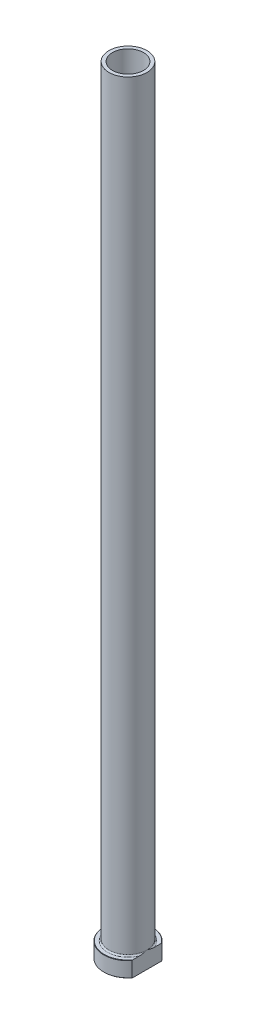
ISO-10303-21;
HEADER;
FILE_DESCRIPTION(('STEP AP214'),'2;1');
FILE_NAME('part.step','',(''),(''),'','','');
FILE_SCHEMA(('AUTOMOTIVE_DESIGN { 1 0 10303 214 1 1 1 1 }'));
ENDSEC;
DATA;
#1=APPLICATION_CONTEXT('core data for automotive mechanical design processes');
#2=APPLICATION_PROTOCOL_DEFINITION('international standard','automotive_design',2000,#1);
#3=PRODUCT_CONTEXT('',#1,'mechanical');
#4=PRODUCT('Part','Part','',(#3));
#5=PRODUCT_RELATED_PRODUCT_CATEGORY('part','',(#4));
#6=PRODUCT_DEFINITION_FORMATION('','',#4);
#7=PRODUCT_DEFINITION_CONTEXT('part definition',#1,'design');
#8=PRODUCT_DEFINITION('design','',#6,#7);
#9=PRODUCT_DEFINITION_SHAPE('','',#8);
#10=(LENGTH_UNIT() NAMED_UNIT(*) SI_UNIT(.MILLI.,.METRE.));
#11=(NAMED_UNIT(*) PLANE_ANGLE_UNIT() SI_UNIT($,.RADIAN.));
#12=(NAMED_UNIT(*) SI_UNIT($,.STERADIAN.) SOLID_ANGLE_UNIT());
#13=UNCERTAINTY_MEASURE_WITH_UNIT(LENGTH_MEASURE(1.E-05),#10,'distance_accuracy_value','');
#14=(GEOMETRIC_REPRESENTATION_CONTEXT(3) GLOBAL_UNCERTAINTY_ASSIGNED_CONTEXT((#13)) GLOBAL_UNIT_ASSIGNED_CONTEXT((#10,
#11,#12)) REPRESENTATION_CONTEXT('',''));
#15=CARTESIAN_POINT('',(0.,0.,0.));
#16=DIRECTION('',(0.,0.,1.));
#17=DIRECTION('',(1.,0.,0.));
#18=AXIS2_PLACEMENT_3D('',#15,#16,#17);
#19=CARTESIAN_POINT('',(0.,92.1876809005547,0.));
#20=DIRECTION('',(0.,1.,0.));
#21=DIRECTION('',(0.,0.,1.));
#22=AXIS2_PLACEMENT_3D('',#19,#20,#21);
#23=CYLINDRICAL_SURFACE('',#22,9.00000000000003);
#24=CARTESIAN_POINT('',(0.,450.,0.));
#25=DIRECTION('',(0.,1.,0.));
#26=DIRECTION('',(0.,0.,1.));
#27=AXIS2_PLACEMENT_3D('',#24,#25,#26);
#28=CIRCLE('',#27,9.00000000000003);
#29=CARTESIAN_POINT('',(0.,450.,9.00000000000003));
#30=VERTEX_POINT('',#29);
#31=EDGE_CURVE('E167',#30,#30,#28,.T.);
#32=ORIENTED_EDGE('',*,*,#31,.T.);
#33=EDGE_LOOP('',(#32));
#34=FACE_BOUND('',#33,.T.);
#35=CARTESIAN_POINT('',(0.,395.,0.));
#36=DIRECTION('',(0.,1.,0.));
#37=DIRECTION('',(0.,0.,1.));
#38=AXIS2_PLACEMENT_3D('',#35,#36,#37);
#39=CIRCLE('',#38,9.00000000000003);
#40=CARTESIAN_POINT('',(0.,395.,9.00000000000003));
#41=VERTEX_POINT('',#40);
#42=EDGE_CURVE('E170',#41,#41,#39,.T.);
#43=ORIENTED_EDGE('',*,*,#42,.F.);
#44=EDGE_LOOP('',(#43));
#45=FACE_BOUND('',#44,.T.);
#46=ADVANCED_FACE('F32',(#34,#45),#23,.F.);
#47=CARTESIAN_POINT('',(-9.00000000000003,450.,0.));
#48=DIRECTION('',(0.,1.,0.));
#49=DIRECTION('',(0.,0.,1.));
#50=AXIS2_PLACEMENT_3D('',#47,#48,#49);
#51=PLANE('',#50);
#52=CARTESIAN_POINT('',(0.,450.,0.));
#53=DIRECTION('',(0.,1.,0.));
#54=DIRECTION('',(0.,0.,1.));
#55=AXIS2_PLACEMENT_3D('',#52,#53,#54);
#56=CIRCLE('',#55,11.);
#57=CARTESIAN_POINT('',(0.,450.,11.));
#58=VERTEX_POINT('',#57);
#59=EDGE_CURVE('E174',#58,#58,#56,.T.);
#60=ORIENTED_EDGE('',*,*,#59,.T.);
#61=EDGE_LOOP('',(#60));
#62=FACE_BOUND('',#61,.T.);
#63=ORIENTED_EDGE('',*,*,#31,.F.);
#64=EDGE_LOOP('',(#63));
#65=FACE_BOUND('',#64,.T.);
#66=ADVANCED_FACE('F157',(#62,#65),#51,.T.);
#67=CARTESIAN_POINT('',(0.,92.1876809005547,0.));
#68=DIRECTION('',(0.,1.,0.));
#69=DIRECTION('',(0.,0.,1.));
#70=AXIS2_PLACEMENT_3D('',#67,#68,#69);
#71=CYLINDRICAL_SURFACE('',#70,11.);
#72=CARTESIAN_POINT('',(0.,9.8,0.));
#73=DIRECTION('',(0.,1.,0.));
#74=DIRECTION('',(0.,0.,1.));
#75=AXIS2_PLACEMENT_3D('',#72,#73,#74);
#76=CIRCLE('',#75,11.);
#77=CARTESIAN_POINT('',(11.,9.8,0.));
#78=VERTEX_POINT('',#77);
#79=EDGE_CURVE('E180',#78,#78,#76,.T.);
#80=ORIENTED_EDGE('',*,*,#79,.T.);
#81=EDGE_LOOP('',(#80));
#82=FACE_BOUND('',#81,.T.);
#83=ORIENTED_EDGE('',*,*,#59,.F.);
#84=EDGE_LOOP('',(#83));
#85=FACE_BOUND('',#84,.T.);
#86=ADVANCED_FACE('F162',(#82,#85),#71,.T.);
#87=CARTESIAN_POINT('',(-11.,9.,0.));
#88=DIRECTION('',(0.,1.,0.));
#89=DIRECTION('',(0.,0.,1.));
#90=AXIS2_PLACEMENT_3D('',#87,#88,#89);
#91=PLANE('',#90);
#92=DIRECTION('',(0.,0.,1.));
#93=VECTOR('',#92,1.);
#94=CARTESIAN_POINT('',(11.,9.,0.));
#95=LINE('',#94,#93);
#96=CARTESIAN_POINT('',(11.,9.,-8.33306666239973));
#97=VERTEX_POINT('',#96);
#98=CARTESIAN_POINT('',(11.,9.,-4.27083130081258));
#99=VERTEX_POINT('',#98);
#100=EDGE_CURVE('E54',#97,#99,#95,.T.);
#101=ORIENTED_EDGE('',*,*,#100,.F.);
#102=CARTESIAN_POINT('',(0.,9.,0.));
#103=DIRECTION('',(0.,1.,0.));
#104=DIRECTION('',(0.,0.,1.));
#105=AXIS2_PLACEMENT_3D('',#102,#103,#104);
#106=CIRCLE('',#105,13.7999999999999);
#107=CARTESIAN_POINT('',(11.,9.,8.33306666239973));
#108=VERTEX_POINT('',#107);
#109=EDGE_CURVE('E186',#97,#108,#106,.T.);
#110=ORIENTED_EDGE('',*,*,#109,.T.);
#111=CARTESIAN_POINT('',(11.,9.,4.27083130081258));
#112=VERTEX_POINT('',#111);
#113=EDGE_CURVE('E134',#112,#108,#95,.T.);
#114=ORIENTED_EDGE('',*,*,#113,.F.);
#115=CARTESIAN_POINT('',(0.,9.,0.));
#116=DIRECTION('',(0.,1.,0.));
#117=DIRECTION('',(0.,0.,1.));
#118=AXIS2_PLACEMENT_3D('',#115,#116,#117);
#119=CIRCLE('',#118,11.8);
#120=EDGE_CURVE('E183',#112,#99,#119,.F.);
#121=ORIENTED_EDGE('',*,*,#120,.T.);
#122=EDGE_LOOP('',(#101,#110,#114,#121));
#123=FACE_BOUND('',#122,.T.);
#124=ADVANCED_FACE('F197',(#123),#91,.T.);
#125=CARTESIAN_POINT('',(0.,92.1876809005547,0.));
#126=DIRECTION('',(0.,1.,0.));
#127=DIRECTION('',(0.,0.,1.));
#128=AXIS2_PLACEMENT_3D('',#125,#126,#127);
#129=CYLINDRICAL_SURFACE('',#128,14.);
#130=DIRECTION('',(0.,-1.,0.));
#131=VECTOR('',#130,1.);
#132=CARTESIAN_POINT('',(11.,450.,8.66025403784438));
#133=LINE('',#132,#131);
#134=CARTESIAN_POINT('',(11.,8.79999999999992,8.66025403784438));
#135=VERTEX_POINT('',#134);
#136=CARTESIAN_POINT('',(11.,0.199999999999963,8.66025403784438));
#137=VERTEX_POINT('',#136);
#138=EDGE_CURVE('E82',#135,#137,#133,.T.);
#139=ORIENTED_EDGE('',*,*,#138,.F.);
#140=CARTESIAN_POINT('',(0.,8.79999999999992,0.));
#141=DIRECTION('',(0.,1.,0.));
#142=DIRECTION('',(0.,0.,1.));
#143=AXIS2_PLACEMENT_3D('',#140,#141,#142);
#144=CIRCLE('',#143,14.);
#145=CARTESIAN_POINT('',(11.,8.79999999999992,-8.66025403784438));
#146=VERTEX_POINT('',#145);
#147=EDGE_CURVE('E95',#135,#146,#144,.F.);
#148=ORIENTED_EDGE('',*,*,#147,.T.);
#149=DIRECTION('',(0.,-1.,0.));
#150=VECTOR('',#149,1.);
#151=CARTESIAN_POINT('',(11.,450.,-8.66025403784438));
#152=LINE('',#151,#150);
#153=CARTESIAN_POINT('',(11.,0.199999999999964,-8.66025403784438));
#154=VERTEX_POINT('',#153);
#155=EDGE_CURVE('E192',#146,#154,#152,.T.);
#156=ORIENTED_EDGE('',*,*,#155,.T.);
#157=CARTESIAN_POINT('',(0.,0.199999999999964,0.));
#158=DIRECTION('',(0.,-1.,0.));
#159=DIRECTION('',(0.,0.,-1.));
#160=AXIS2_PLACEMENT_3D('',#157,#158,#159);
#161=CIRCLE('',#160,14.);
#162=EDGE_CURVE('E98',#154,#137,#161,.F.);
#163=ORIENTED_EDGE('',*,*,#162,.T.);
#164=EDGE_LOOP('',(#139,#148,#156,#163));
#165=FACE_BOUND('',#164,.T.);
#166=ADVANCED_FACE('F190',(#165),#129,.T.);
#167=CARTESIAN_POINT('',(-14.,0.,0.));
#168=DIRECTION('',(0.,-1.,0.));
#169=DIRECTION('',(0.,0.,-1.));
#170=AXIS2_PLACEMENT_3D('',#167,#168,#169);
#171=PLANE('',#170);
#172=CARTESIAN_POINT('',(0.,0.,0.));
#173=DIRECTION('',(0.,-1.,0.));
#174=DIRECTION('',(0.,0.,-1.));
#175=AXIS2_PLACEMENT_3D('',#172,#173,#174);
#176=CIRCLE('',#175,9.75000000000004);
#177=CARTESIAN_POINT('',(0.,0.,-9.75000000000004));
#178=VERTEX_POINT('',#177);
#179=EDGE_CURVE('E40',#178,#178,#176,.F.);
#180=ORIENTED_EDGE('',*,*,#179,.T.);
#181=EDGE_LOOP('',(#180));
#182=FACE_BOUND('',#181,.T.);
#183=DIRECTION('',(0.,0.,-1.));
#184=VECTOR('',#183,1.);
#185=CARTESIAN_POINT('',(11.,0.,8.66025403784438));
#186=LINE('',#185,#184);
#187=CARTESIAN_POINT('',(11.,0.,8.33306666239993));
#188=VERTEX_POINT('',#187);
#189=CARTESIAN_POINT('',(11.,0.,-8.33306666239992));
#190=VERTEX_POINT('',#189);
#191=EDGE_CURVE('E47',#188,#190,#186,.T.);
#192=ORIENTED_EDGE('',*,*,#191,.F.);
#193=CARTESIAN_POINT('',(0.,0.,0.));
#194=DIRECTION('',(0.,-1.,0.));
#195=DIRECTION('',(0.,0.,-1.));
#196=AXIS2_PLACEMENT_3D('',#193,#194,#195);
#197=CIRCLE('',#196,13.8);
#198=EDGE_CURVE('E92',#188,#190,#197,.T.);
#199=ORIENTED_EDGE('',*,*,#198,.T.);
#200=EDGE_LOOP('',(#192,#199));
#201=FACE_BOUND('',#200,.T.);
#202=ADVANCED_FACE('F91',(#182,#201),#171,.T.);
#203=CARTESIAN_POINT('',(0.,92.1876809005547,0.));
#204=DIRECTION('',(0.,1.,0.));
#205=DIRECTION('',(0.,0.,1.));
#206=AXIS2_PLACEMENT_3D('',#203,#204,#205);
#207=CYLINDRICAL_SURFACE('',#206,9.25000000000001);
#208=CARTESIAN_POINT('',(0.,0.500000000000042,0.));
#209=DIRECTION('',(0.,-1.,0.));
#210=DIRECTION('',(0.,0.,-1.));
#211=AXIS2_PLACEMENT_3D('',#208,#209,#210);
#212=CIRCLE('',#211,9.25000000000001);
#213=CARTESIAN_POINT('',(0.,0.500000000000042,-9.25000000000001));
#214=VERTEX_POINT('',#213);
#215=EDGE_CURVE('E11',#214,#214,#212,.T.);
#216=ORIENTED_EDGE('',*,*,#215,.T.);
#217=EDGE_LOOP('',(#216));
#218=FACE_BOUND('',#217,.T.);
#219=CARTESIAN_POINT('',(0.,383.,0.));
#220=DIRECTION('',(0.,1.,0.));
#221=DIRECTION('',(0.,0.,1.));
#222=AXIS2_PLACEMENT_3D('',#219,#220,#221);
#223=CIRCLE('',#222,9.25000000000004);
#224=CARTESIAN_POINT('',(0.,383.,9.25000000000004));
#225=VERTEX_POINT('',#224);
#226=EDGE_CURVE('E172',#225,#225,#223,.T.);
#227=ORIENTED_EDGE('',*,*,#226,.T.);
#228=EDGE_LOOP('',(#227));
#229=FACE_BOUND('',#228,.T.);
#230=ADVANCED_FACE('F215',(#218,#229),#207,.F.);
#231=CARTESIAN_POINT('',(0.,383.,0.));
#232=DIRECTION('',(0.,-1.,0.));
#233=DIRECTION('',(0.,0.,-1.));
#234=AXIS2_PLACEMENT_3D('',#231,#232,#233);
#235=CONICAL_SURFACE('',#234,9.25000000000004,0.0208303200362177);
#236=ORIENTED_EDGE('',*,*,#42,.T.);
#237=EDGE_LOOP('',(#236));
#238=FACE_BOUND('',#237,.T.);
#239=ORIENTED_EDGE('',*,*,#226,.F.);
#240=EDGE_LOOP('',(#239));
#241=FACE_BOUND('',#240,.T.);
#242=ADVANCED_FACE('F111',(#238,#241),#235,.F.);
#243=CARTESIAN_POINT('',(0.,9.8,0.));
#244=DIRECTION('',(0.,1.,0.));
#245=DIRECTION('',(0.,0.,1.));
#246=AXIS2_PLACEMENT_3D('',#243,#244,#245);
#247=TOROIDAL_SURFACE('',#246,11.8,0.8);
#248=ORIENTED_EDGE('',*,*,#120,.F.);
#249=CARTESIAN_POINT('',(11.,9.8,0.));
#250=CARTESIAN_POINT('',(11.,9.80000101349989,-1.16902822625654E-10));
#251=CARTESIAN_POINT('',(11.,9.80000202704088,3.62637024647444E-07));
#252=CARTESIAN_POINT('',(11.,9.80000392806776,1.3876712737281E-06));
#253=CARTESIAN_POINT('',(11.,9.80000479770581,2.07263875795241E-06));
#254=CARTESIAN_POINT('',(11.,9.80000659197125,3.71036821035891E-06));
#255=CARTESIAN_POINT('',(11.,9.80000749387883,4.68930389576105E-06));
#256=CARTESIAN_POINT('',(11.,9.80000912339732,6.73011775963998E-06));
#257=CARTESIAN_POINT('',(11.,9.80000985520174,7.78888343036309E-06));
#258=CARTESIAN_POINT('',(11.,9.80001253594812,1.18457687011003E-05));
#259=CARTESIAN_POINT('',(11.,9.80001433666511,1.49465110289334E-05));
#260=CARTESIAN_POINT('',(11.,9.80001733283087,2.11226803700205E-05));
#261=CARTESIAN_POINT('',(11.,9.80001856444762,2.41813401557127E-05));
#262=CARTESIAN_POINT('',(11.,9.80002366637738,3.70013823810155E-05));
#263=CARTESIAN_POINT('',(11.,9.80002742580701,4.68141808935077E-05));
#264=CARTESIAN_POINT('',(11.,9.80003302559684,6.54425782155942E-05));
#265=CARTESIAN_POINT('',(11.,9.80003506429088,7.41984192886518E-05));
#266=CARTESIAN_POINT('',(11.,9.80004981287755,0.000138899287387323));
#267=CARTESIAN_POINT('',(11.,9.80006088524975,0.000195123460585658));
#268=CARTESIAN_POINT('',(11.,9.80010935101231,0.000417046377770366));
#269=CARTESIAN_POINT('',(11.,9.80015570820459,0.000580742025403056));
#270=CARTESIAN_POINT('',(11.,9.80033600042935,0.00122860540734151));
#271=CARTESIAN_POINT('',(11.,9.80046404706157,0.00171390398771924));
#272=CARTESIAN_POINT('',(11.,9.80097655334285,0.00364143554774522));
#273=CARTESIAN_POINT('',(11.,9.80136837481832,0.00508221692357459));
#274=CARTESIAN_POINT('',(11.,9.80300002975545,0.0110983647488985));
#275=CARTESIAN_POINT('',(11.,9.80423069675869,0.0156755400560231));
#276=CARTESIAN_POINT('',(10.9999999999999,9.82474721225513,0.091959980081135));
#277=CARTESIAN_POINT('',(11.,9.84411511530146,0.163651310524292));
#278=CARTESIAN_POINT('',(11.,9.88193435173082,0.304144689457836));
#279=CARTESIAN_POINT('',(11.,9.90039088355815,0.372945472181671));
#280=CARTESIAN_POINT('',(11.,9.93953155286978,0.519420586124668));
#281=CARTESIAN_POINT('',(11.,9.96019740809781,0.597099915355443));
#282=CARTESIAN_POINT('',(11.,10.0014716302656,0.753402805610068));
#283=CARTESIAN_POINT('',(11.,10.022076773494,0.832027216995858));
#284=CARTESIAN_POINT('',(11.,10.0569012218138,0.966276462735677));
#285=CARTESIAN_POINT('',(11.,10.0712190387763,1.02187571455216));
#286=CARTESIAN_POINT('',(11.,10.099582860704,1.13298938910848));
#287=CARTESIAN_POINT('',(11.,10.1136294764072,1.1885036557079));
#288=CARTESIAN_POINT('',(11.,10.1546367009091,1.35225812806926));
#289=CARTESIAN_POINT('',(11.,10.1812165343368,1.46059357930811));
#290=CARTESIAN_POINT('',(11.,10.2669117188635,1.81933910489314));
#291=CARTESIAN_POINT('',(11.,10.3231642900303,2.07044657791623));
#292=CARTESIAN_POINT('',(11.,10.4250125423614,2.57779828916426));
#293=CARTESIAN_POINT('',(11.,10.470483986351,2.83406864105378));
#294=CARTESIAN_POINT('',(11.,10.5272211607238,3.23096220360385));
#295=CARTESIAN_POINT('',(11.,10.5446090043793,3.3707025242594));
#296=CARTESIAN_POINT('',(11.,10.5730475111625,3.65081430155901));
#297=CARTESIAN_POINT('',(11.,10.5840998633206,3.79118557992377));
#298=CARTESIAN_POINT('',(11.,10.5982304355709,4.07161741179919));
#299=CARTESIAN_POINT('',(11.,10.6013499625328,4.21167576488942));
#300=CARTESIAN_POINT('',(11.,10.5975625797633,4.49161919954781));
#301=CARTESIAN_POINT('',(11.,10.5906655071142,4.63150431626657));
#302=CARTESIAN_POINT('',(11.,10.5704363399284,4.83931097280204));
#303=CARTESIAN_POINT('',(11.,10.5621463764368,4.90772588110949));
#304=CARTESIAN_POINT('',(11.,10.5417448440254,5.04405523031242));
#305=CARTESIAN_POINT('',(11.,10.5296301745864,5.11196921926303));
#306=CARTESIAN_POINT('',(11.,10.5009997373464,5.24610291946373));
#307=CARTESIAN_POINT('',(11.,10.4845340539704,5.31233305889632));
#308=CARTESIAN_POINT('',(11.,10.4461783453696,5.4431471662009));
#309=CARTESIAN_POINT('',(11.,10.4242944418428,5.5077329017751));
#310=CARTESIAN_POINT('',(11.,10.3734211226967,5.63494480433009));
#311=CARTESIAN_POINT('',(11.,10.3443615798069,5.6975442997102));
#312=CARTESIAN_POINT('',(11.,10.294012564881,5.78758577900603));
#313=CARTESIAN_POINT('',(11.,10.276124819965,5.8169284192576));
#314=CARTESIAN_POINT('',(11.,10.2377448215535,5.87384301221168));
#315=CARTESIAN_POINT('',(11.,10.2172553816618,5.9014168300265));
#316=CARTESIAN_POINT('',(11.,10.1754926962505,5.95144540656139));
#317=CARTESIAN_POINT('',(11.,10.1545053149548,5.97413611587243));
#318=CARTESIAN_POINT('',(11.,10.1098178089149,6.01675330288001));
#319=CARTESIAN_POINT('',(11.,10.0861159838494,6.03667803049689));
#320=CARTESIAN_POINT('',(11.,10.0355211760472,6.07288913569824));
#321=CARTESIAN_POINT('',(11.,10.0085887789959,6.08912169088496));
#322=CARTESIAN_POINT('',(11.,9.95208821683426,6.11604527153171));
#323=CARTESIAN_POINT('',(11.,9.92252876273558,6.126753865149));
#324=CARTESIAN_POINT('',(11.,9.87044933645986,6.13915978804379));
#325=CARTESIAN_POINT('',(11.,9.84833164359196,6.14255775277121));
#326=CARTESIAN_POINT('',(11.,9.80383923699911,6.14553082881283));
#327=CARTESIAN_POINT('',(11.,9.7814646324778,6.14510750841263));
#328=CARTESIAN_POINT('',(11.,9.73715415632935,6.14047859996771));
#329=CARTESIAN_POINT('',(11.,9.71521765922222,6.13627886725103));
#330=CARTESIAN_POINT('',(11.,9.67228934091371,6.12446633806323));
#331=CARTESIAN_POINT('',(11.,9.65129820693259,6.11685110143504));
#332=CARTESIAN_POINT('',(11.,9.6029388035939,6.09531376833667));
#333=CARTESIAN_POINT('',(11.,9.57614979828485,6.08009633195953));
#334=CARTESIAN_POINT('',(11.,9.52533680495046,6.04559207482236));
#335=CARTESIAN_POINT('',(11.,9.50131971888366,6.02629542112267));
#336=CARTESIAN_POINT('',(11.,9.44252607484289,5.97248581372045));
#337=CARTESIAN_POINT('',(11.,9.4098152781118,5.93573547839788));
#338=CARTESIAN_POINT('',(11.,9.35019076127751,5.85789950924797));
#339=CARTESIAN_POINT('',(11.,9.32328591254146,5.81680738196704));
#340=CARTESIAN_POINT('',(11.,9.27531247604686,5.73382009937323));
#341=CARTESIAN_POINT('',(11.,9.25403723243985,5.69204233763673));
#342=CARTESIAN_POINT('',(11.,9.21507165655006,5.60682590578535));
#343=CARTESIAN_POINT('',(11.,9.19738479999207,5.56338567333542));
#344=CARTESIAN_POINT('',(11.,9.16492416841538,5.47505507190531));
#345=CARTESIAN_POINT('',(11.,9.15017444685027,5.43015597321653));
#346=CARTESIAN_POINT('',(11.,9.12332484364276,5.33960740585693));
#347=CARTESIAN_POINT('',(11.,9.11122363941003,5.29395832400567));
#348=CARTESIAN_POINT('',(11.,9.08512909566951,5.18461425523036));
#349=CARTESIAN_POINT('',(11.,9.0721724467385,5.12067246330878));
#350=CARTESIAN_POINT('',(11.,9.04991113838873,4.99214785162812));
#351=CARTESIAN_POINT('',(11.,9.04060805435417,4.9275647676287));
#352=CARTESIAN_POINT('',(11.,9.01731839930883,4.7329421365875));
#353=CARTESIAN_POINT('',(11.,9.00801869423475,4.60233754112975));
#354=CARTESIAN_POINT('',(11.,8.9990294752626,4.3455019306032));
#355=CARTESIAN_POINT('',(11.,8.9990127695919,4.21927902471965));
#356=CARTESIAN_POINT('',(11.,9.00595929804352,3.9677119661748));
#357=CARTESIAN_POINT('',(11.,9.01288556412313,3.84236670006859));
#358=CARTESIAN_POINT('',(11.,9.03307410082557,3.58284783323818));
#359=CARTESIAN_POINT('',(11.,9.04676832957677,3.44870920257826));
#360=CARTESIAN_POINT('',(11.,9.07939011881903,3.18114709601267));
#361=CARTESIAN_POINT('',(11.,9.09831526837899,3.04772331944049));
#362=CARTESIAN_POINT('',(11.,9.14092023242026,2.77842123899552));
#363=CARTESIAN_POINT('',(11.,9.16470161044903,2.6425592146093));
#364=CARTESIAN_POINT('',(11.,9.21593088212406,2.37116504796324));
#365=CARTESIAN_POINT('',(11.,9.24338827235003,2.23563471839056));
#366=CARTESIAN_POINT('',(11.,9.31183649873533,1.91532204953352));
#367=CARTESIAN_POINT('',(11.,9.35408384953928,1.73080986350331));
#368=CARTESIAN_POINT('',(11.,9.44184141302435,1.36477440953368));
#369=CARTESIAN_POINT('',(11.,9.48730948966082,1.18324089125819));
#370=CARTESIAN_POINT('',(11.,9.55452451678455,0.921934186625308));
#371=CARTESIAN_POINT('',(11.,9.57534575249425,0.841920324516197));
#372=CARTESIAN_POINT('',(11.,9.61742284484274,0.681633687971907));
#373=CARTESIAN_POINT('',(11.,9.63868020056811,0.601361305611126));
#374=CARTESIAN_POINT('',(11.,9.68246779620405,0.436916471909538));
#375=CARTESIAN_POINT('',(11.,9.70500908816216,0.352747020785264));
#376=CARTESIAN_POINT('',(11.,9.74991333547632,0.185809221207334));
#377=CARTESIAN_POINT('',(11.,9.77227331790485,0.103040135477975));
#378=CARTESIAN_POINT('',(11.,9.79577053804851,0.0156708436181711));
#379=CARTESIAN_POINT('',(11.,9.7970024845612,0.0110889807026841));
#380=CARTESIAN_POINT('',(11.,9.79863444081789,0.00507176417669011));
#381=CARTESIAN_POINT('',(11.,9.79902527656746,0.00363459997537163));
#382=CARTESIAN_POINT('',(11.,9.79953658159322,0.00171158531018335));
#383=CARTESIAN_POINT('',(11.,9.79966439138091,0.00122718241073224));
#384=CARTESIAN_POINT('',(11.,9.79984439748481,0.000580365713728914));
#385=CARTESIAN_POINT('',(11.,9.7998907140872,0.000416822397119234));
#386=CARTESIAN_POINT('',(11.,9.79993914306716,0.000195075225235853));
#387=CARTESIAN_POINT('',(11.,9.79995021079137,0.000138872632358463));
#388=CARTESIAN_POINT('',(11.,9.79996494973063,7.41937319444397E-05));
#389=CARTESIAN_POINT('',(11.,9.79996698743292,6.54391093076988E-05));
#390=CARTESIAN_POINT('',(11.,9.7999725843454,4.68131927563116E-05));
#391=CARTESIAN_POINT('',(11.,9.79997634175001,3.70015919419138E-05));
#392=CARTESIAN_POINT('',(11.,9.79998144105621,2.41827857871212E-05));
#393=CARTESIAN_POINT('',(11.,9.7999826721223,2.11242171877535E-05));
#394=CARTESIAN_POINT('',(11.,9.79998566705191,1.49481378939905E-05));
#395=CARTESIAN_POINT('',(11.,9.79998746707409,1.18473833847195E-05));
#396=CARTESIAN_POINT('',(11.,9.79999014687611,7.79037383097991E-06));
#397=CARTESIAN_POINT('',(11.,9.79999087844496,6.73154601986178E-06));
#398=CARTESIAN_POINT('',(11.,9.79999250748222,4.69056535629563E-06));
#399=CARTESIAN_POINT('',(11.,9.79999340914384,3.71152360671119E-06));
#400=CARTESIAN_POINT('',(11.,9.79999520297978,2.07354406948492E-06));
#401=CARTESIAN_POINT('',(11.,9.79999607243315,1.38844163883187E-06));
#402=CARTESIAN_POINT('',(11.,9.79999797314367,3.63067988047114E-07));
#403=CARTESIAN_POINT('',(11.,9.79999898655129,1.16901326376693E-10));
#404=CARTESIAN_POINT('',(11.,9.8,0.));
#405=B_SPLINE_CURVE_WITH_KNOTS('',3,(#249,#250,#251,#252,#253,#254,#255,#256,#257,#258,#259,
#260,#261,#262,#263,#264,#265,#266,#267,#268,#269,#270,#271,#272,#273,#274,#275,#276,#277,#278,
#279,#280,#281,#282,#283,#284,#285,#286,#287,#288,#289,#290,#291,#292,#293,#294,#295,#296,#297,
#298,#299,#300,#301,#302,#303,#304,#305,#306,#307,#308,#309,#310,#311,#312,#313,#314,#315,#316,
#317,#318,#319,#320,#321,#322,#323,#324,#325,#326,#327,#328,#329,#330,#331,#332,#333,#334,#335,
#336,#337,#338,#339,#340,#341,#342,#343,#344,#345,#346,#347,#348,#349,#350,#351,#352,#353,#354,
#355,#356,#357,#358,#359,#360,#361,#362,#363,#364,#365,#366,#367,#368,#369,#370,#371,#372,#373,
#374,#375,#376,#377,#378,#379,#380,#381,#382,#383,#384,#385,#386,#387,#388,#389,#390,#391,#392,
#393,#394,#395,#396,#397,#398,#399,#400,#401,#402,#403,#404),.UNSPECIFIED.,.T.,.F.,(4,2,2,2,2,2,
2,2,2,2,2,2,2,2,2,2,2,2,2,2,2,2,2,2,2,2,2,2,2,2,2,2,2,2,2,2,2,2,2,2,2,2,2,2,2,2,2,2,2,2,2,2,2,2,
2,2,2,2,2,2,2,2,2,2,2,2,2,2,2,2,2,2,2,2,2,2,2,4),(0.,3.06075584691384E-06,6.37972597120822E-06,
1.0350254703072E-05,1.42089570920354E-05,2.49252383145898E-05,3.48085324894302E-05,
6.62739174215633E-05,9.32104158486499E-05,0.000265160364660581,0.000775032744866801,
0.00228129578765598,0.00675996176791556,0.0209798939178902,0.243756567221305,0.457458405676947,
0.698601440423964,0.942439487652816,1.11467870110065,1.28646938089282,1.62111125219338,
2.39296447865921,3.17332138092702,3.59566656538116,4.01789910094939,4.43792849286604,
4.85754566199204,5.06420795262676,5.27103820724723,5.47558418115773,5.67990009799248,
5.88629782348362,5.98928489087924,6.09216151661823,6.18469603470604,6.2772888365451,
6.37115541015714,6.46472158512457,6.53154940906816,6.59834980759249,6.66504681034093,
6.73179153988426,6.82369899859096,6.91583057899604,7.06259901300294,7.2095901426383,
7.35003074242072,7.49060673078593,7.63229046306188,7.77390328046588,7.96948934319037,
8.16515964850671,8.55744262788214,8.93589815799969,9.31234923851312,9.71673016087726,
10.120925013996,10.5346477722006,10.9494607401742,11.517259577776,12.0786596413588,
12.3266950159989,12.5758117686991,12.837220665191,13.0944202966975,13.1086548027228,
13.1131222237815,13.1146257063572,13.1151351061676,13.1153069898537,13.1153339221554,
13.1153653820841,13.1153752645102,13.1153859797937,13.1153898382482,13.1153938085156,
13.115397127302,13.1154001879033),.UNSPECIFIED.);
#406=EDGE_CURVE('E126',#112,#78,#405,.T.);
#407=ORIENTED_EDGE('',*,*,#406,.T.);
#408=ORIENTED_EDGE('',*,*,#79,.F.);
#409=CARTESIAN_POINT('',(11.,9.8,0.));
#410=CARTESIAN_POINT('',(11.,9.79999898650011,1.16907031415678E-10));
#411=CARTESIAN_POINT('',(11.,9.79999797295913,-3.62637020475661E-07));
#412=CARTESIAN_POINT('',(11.,9.79999607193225,-1.38767126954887E-06));
#413=CARTESIAN_POINT('',(11.,9.7999952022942,-2.07263875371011E-06));
#414=CARTESIAN_POINT('',(11.,9.79999340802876,-3.7103682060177E-06));
#415=CARTESIAN_POINT('',(11.,9.79999250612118,-4.68930389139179E-06));
#416=CARTESIAN_POINT('',(11.,9.79999087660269,-6.73011775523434E-06));
#417=CARTESIAN_POINT('',(11.,9.79999014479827,-7.7888834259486E-06));
#418=CARTESIAN_POINT('',(11.,9.79998746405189,-1.18457686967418E-05));
#419=CARTESIAN_POINT('',(11.,9.7999856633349,-1.49465110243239E-05));
#420=CARTESIAN_POINT('',(11.,9.79998266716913,-2.1122680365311E-05));
#421=CARTESIAN_POINT('',(11.,9.79998143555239,-2.41813401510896E-05));
#422=CARTESIAN_POINT('',(11.,9.79997633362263,-3.70013823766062E-05));
#423=CARTESIAN_POINT('',(11.,9.79997257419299,-4.68141808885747E-05));
#424=CARTESIAN_POINT('',(11.,9.79996697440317,-6.54425782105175E-05));
#425=CARTESIAN_POINT('',(11.,9.79996493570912,-7.41984192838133E-05));
#426=CARTESIAN_POINT('',(11.,9.79995018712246,-0.000138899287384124));
#427=CARTESIAN_POINT('',(11.,9.79993911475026,-0.000195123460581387));
#428=CARTESIAN_POINT('',(11.,9.79989064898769,-0.000417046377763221));
#429=CARTESIAN_POINT('',(11.,9.79984429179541,-0.000580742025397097));
#430=CARTESIAN_POINT('',(11.,9.79966399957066,-0.0012286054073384));
#431=CARTESIAN_POINT('',(11.,9.79953595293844,-0.00171390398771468));
#432=CARTESIAN_POINT('',(11.,9.79902344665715,-0.00364143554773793));
#433=CARTESIAN_POINT('',(11.,9.79863162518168,-0.00508221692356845));
#434=CARTESIAN_POINT('',(11.,9.79699997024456,-0.0110983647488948));
#435=CARTESIAN_POINT('',(11.,9.79576930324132,-0.0156755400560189));
#436=CARTESIAN_POINT('',(11.,9.77525278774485,-0.0919599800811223));
#437=CARTESIAN_POINT('',(11.,9.75588488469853,-0.163651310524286));
#438=CARTESIAN_POINT('',(11.,9.71806564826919,-0.304144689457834));
#439=CARTESIAN_POINT('',(11.,9.69960911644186,-0.372945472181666));
#440=CARTESIAN_POINT('',(11.,9.66046844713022,-0.519420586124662));
#441=CARTESIAN_POINT('',(11.,9.63980259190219,-0.597099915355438));
#442=CARTESIAN_POINT('',(11.,9.59852836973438,-0.753402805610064));
#443=CARTESIAN_POINT('',(11.,9.57792322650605,-0.832027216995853));
#444=CARTESIAN_POINT('',(11.,9.54309877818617,-0.966276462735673));
#445=CARTESIAN_POINT('',(11.,9.52878096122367,-1.02187571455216));
#446=CARTESIAN_POINT('',(11.,9.500417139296,-1.13298938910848));
#447=CARTESIAN_POINT('',(11.,9.48637052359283,-1.1885036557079));
#448=CARTESIAN_POINT('',(11.,9.44536329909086,-1.35225812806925));
#449=CARTESIAN_POINT('',(11.,9.41878346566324,-1.46059357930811));
#450=CARTESIAN_POINT('',(11.,9.33308828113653,-1.81933910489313));
#451=CARTESIAN_POINT('',(11.,9.27683570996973,-2.07044657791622));
#452=CARTESIAN_POINT('',(11.,9.17498745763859,-2.57779828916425));
#453=CARTESIAN_POINT('',(11.,9.129516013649,-2.83406864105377));
#454=CARTESIAN_POINT('',(11.,9.07277883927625,-3.23096220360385));
#455=CARTESIAN_POINT('',(11.,9.05539099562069,-3.3707025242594));
#456=CARTESIAN_POINT('',(11.,9.0269524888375,-3.650814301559));
#457=CARTESIAN_POINT('',(11.,9.0159001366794,-3.79118557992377));
#458=CARTESIAN_POINT('',(11.,9.00176956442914,-4.07161741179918));
#459=CARTESIAN_POINT('',(11.,8.99865003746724,-4.21167576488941));
#460=CARTESIAN_POINT('',(11.,9.00243742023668,-4.4916191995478));
#461=CARTESIAN_POINT('',(11.,9.00933449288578,-4.63150431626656));
#462=CARTESIAN_POINT('',(11.,9.02956366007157,-4.83931097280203));
#463=CARTESIAN_POINT('',(11.,9.0378536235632,-4.90772588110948));
#464=CARTESIAN_POINT('',(11.,9.0582551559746,-5.04405523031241));
#465=CARTESIAN_POINT('',(11.,9.07036982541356,-5.11196921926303));
#466=CARTESIAN_POINT('',(11.,9.09900026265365,-5.24610291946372));
#467=CARTESIAN_POINT('',(11.,9.11546594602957,-5.31233305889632));
#468=CARTESIAN_POINT('',(11.,9.15382165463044,-5.4431471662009));
#469=CARTESIAN_POINT('',(11.,9.1757055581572,-5.50773290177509));
#470=CARTESIAN_POINT('',(11.,9.22657887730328,-5.63494480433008));
#471=CARTESIAN_POINT('',(11.,9.25563842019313,-5.6975442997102));
#472=CARTESIAN_POINT('',(11.,9.30598743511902,-5.78758577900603));
#473=CARTESIAN_POINT('',(11.,9.32387518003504,-5.8169284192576));
#474=CARTESIAN_POINT('',(11.,9.36225517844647,-5.87384301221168));
#475=CARTESIAN_POINT('',(11.,9.38274461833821,-5.9014168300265));
#476=CARTESIAN_POINT('',(11.,9.42450730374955,-5.95144540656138));
#477=CARTESIAN_POINT('',(11.,9.44549468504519,-5.97413611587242));
#478=CARTESIAN_POINT('',(11.,9.49018219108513,-6.01675330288));
#479=CARTESIAN_POINT('',(11.,9.51388401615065,-6.03667803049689));
#480=CARTESIAN_POINT('',(11.,9.56447882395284,-6.07288913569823));
#481=CARTESIAN_POINT('',(11.,9.59141122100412,-6.08912169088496));
#482=CARTESIAN_POINT('',(11.,9.64791178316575,-6.1160452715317));
#483=CARTESIAN_POINT('',(11.,9.67747123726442,-6.126753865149));
#484=CARTESIAN_POINT('',(11.,9.72955066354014,-6.13915978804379));
#485=CARTESIAN_POINT('',(11.,9.75166835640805,-6.1425577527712));
#486=CARTESIAN_POINT('',(11.,9.7961607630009,-6.14553082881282));
#487=CARTESIAN_POINT('',(11.,9.81853536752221,-6.14510750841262));
#488=CARTESIAN_POINT('',(11.,9.86284584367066,-6.1404785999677));
#489=CARTESIAN_POINT('',(11.,9.88478234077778,-6.13627886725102));
#490=CARTESIAN_POINT('',(11.,9.9277106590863,-6.12446633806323));
#491=CARTESIAN_POINT('',(11.,9.94870179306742,-6.11685110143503));
#492=CARTESIAN_POINT('',(11.,9.9970611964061,-6.09531376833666));
#493=CARTESIAN_POINT('',(11.,10.0238502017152,-6.08009633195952));
#494=CARTESIAN_POINT('',(11.,10.0746631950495,-6.04559207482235));
#495=CARTESIAN_POINT('',(11.,10.0986802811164,-6.02629542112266));
#496=CARTESIAN_POINT('',(11.,10.1574739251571,-5.97248581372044));
#497=CARTESIAN_POINT('',(11.,10.1901847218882,-5.93573547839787));
#498=CARTESIAN_POINT('',(11.,10.2498092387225,-5.85789950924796));
#499=CARTESIAN_POINT('',(11.,10.2767140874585,-5.81680738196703));
#500=CARTESIAN_POINT('',(11.,10.3246875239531,-5.73382009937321));
#501=CARTESIAN_POINT('',(11.,10.3459627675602,-5.69204233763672));
#502=CARTESIAN_POINT('',(11.,10.38492834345,-5.60682590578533));
#503=CARTESIAN_POINT('',(11.,10.4026152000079,-5.56338567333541));
#504=CARTESIAN_POINT('',(11.,10.4350758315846,-5.47505507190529));
#505=CARTESIAN_POINT('',(11.,10.4498255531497,-5.43015597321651));
#506=CARTESIAN_POINT('',(11.,10.4766751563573,-5.33960740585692));
#507=CARTESIAN_POINT('',(11.,10.48877636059,-5.29395832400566));
#508=CARTESIAN_POINT('',(11.,10.5148709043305,-5.18461425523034));
#509=CARTESIAN_POINT('',(11.,10.5278275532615,-5.12067246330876));
#510=CARTESIAN_POINT('',(11.,10.5500888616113,-4.9921478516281));
#511=CARTESIAN_POINT('',(11.,10.5593919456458,-4.92756476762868));
#512=CARTESIAN_POINT('',(11.,10.5826816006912,-4.73294213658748));
#513=CARTESIAN_POINT('',(11.,10.5919813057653,-4.60233754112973));
#514=CARTESIAN_POINT('',(11.,10.6009705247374,-4.34550193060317));
#515=CARTESIAN_POINT('',(11.,10.6009872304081,-4.21927902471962));
#516=CARTESIAN_POINT('',(11.,10.5940407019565,-3.96771196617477));
#517=CARTESIAN_POINT('',(11.,10.5871144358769,-3.84236670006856));
#518=CARTESIAN_POINT('',(11.,10.5669258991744,-3.58284783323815));
#519=CARTESIAN_POINT('',(11.,10.5532316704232,-3.44870920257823));
#520=CARTESIAN_POINT('',(11.,10.520609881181,-3.18114709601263));
#521=CARTESIAN_POINT('',(11.,10.501684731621,-3.04772331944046));
#522=CARTESIAN_POINT('',(11.,10.4590797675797,-2.77842123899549));
#523=CARTESIAN_POINT('',(11.,10.435298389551,-2.64255921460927));
#524=CARTESIAN_POINT('',(11.,10.3840691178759,-2.37116504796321));
#525=CARTESIAN_POINT('',(11.,10.35661172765,-2.23563471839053));
#526=CARTESIAN_POINT('',(11.,10.2881635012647,-1.9153220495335));
#527=CARTESIAN_POINT('',(11.,10.2459161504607,-1.73080986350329));
#528=CARTESIAN_POINT('',(11.,10.1581585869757,-1.36477440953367));
#529=CARTESIAN_POINT('',(11.,10.1126905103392,-1.18324089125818));
#530=CARTESIAN_POINT('',(11.,10.0454754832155,-0.921934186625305));
#531=CARTESIAN_POINT('',(11.,10.0246542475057,-0.841920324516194));
#532=CARTESIAN_POINT('',(11.,9.98257715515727,-0.681633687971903));
#533=CARTESIAN_POINT('',(11.,9.96131979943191,-0.60136130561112));
#534=CARTESIAN_POINT('',(11.,9.91753220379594,-0.43691647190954));
#535=CARTESIAN_POINT('',(11.,9.8949909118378,-0.352747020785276));
#536=CARTESIAN_POINT('',(11.,9.85008666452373,-0.185809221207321));
#537=CARTESIAN_POINT('',(11.,9.82772668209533,-0.103040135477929));
#538=CARTESIAN_POINT('',(11.,9.80422946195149,-0.0156708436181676));
#539=CARTESIAN_POINT('',(11.,9.80299751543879,-0.0110889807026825));
#540=CARTESIAN_POINT('',(11.,9.80136555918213,-0.00507176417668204));
#541=CARTESIAN_POINT('',(11.,9.80097472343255,-0.00363459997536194));
#542=CARTESIAN_POINT('',(11.,9.80046341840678,-0.00171158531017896));
#543=CARTESIAN_POINT('',(11.,9.80033560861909,-0.00122718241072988));
#544=CARTESIAN_POINT('',(11.,9.8001556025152,-0.000580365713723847));
#545=CARTESIAN_POINT('',(11.,9.80010928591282,-0.000416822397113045));
#546=CARTESIAN_POINT('',(11.,9.80006085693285,-0.000195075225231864));
#547=CARTESIAN_POINT('',(11.,9.80004978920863,-0.000138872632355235));
#548=CARTESIAN_POINT('',(11.,9.80003505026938,-7.41937319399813E-05));
#549=CARTESIAN_POINT('',(11.,9.80003301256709,-6.54391093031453E-05));
#550=CARTESIAN_POINT('',(11.,9.80002741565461,-4.68131927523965E-05));
#551=CARTESIAN_POINT('',(11.,9.80002365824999,-3.70015919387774E-05));
#552=CARTESIAN_POINT('',(11.,9.8000185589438,-2.41827857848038E-05));
#553=CARTESIAN_POINT('',(11.,9.80001732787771,-2.11242171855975E-05));
#554=CARTESIAN_POINT('',(11.,9.80001433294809,-1.49481378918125E-05));
#555=CARTESIAN_POINT('',(11.,9.80001253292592,-1.18473833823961E-05));
#556=CARTESIAN_POINT('',(11.,9.8000098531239,-7.79037382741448E-06));
#557=CARTESIAN_POINT('',(11.,9.80000912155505,-6.73154601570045E-06));
#558=CARTESIAN_POINT('',(11.,9.80000749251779,-4.69056535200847E-06));
#559=CARTESIAN_POINT('',(11.,9.80000659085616,-3.71152360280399E-06));
#560=CARTESIAN_POINT('',(11.,9.80000479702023,-2.07354406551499E-06));
#561=CARTESIAN_POINT('',(11.,9.80000392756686,-1.3884416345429E-06));
#562=CARTESIAN_POINT('',(11.,9.80000202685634,-3.63067983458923E-07));
#563=CARTESIAN_POINT('',(11.,9.80000101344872,-1.16896721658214E-10));
#564=CARTESIAN_POINT('',(11.,9.8,0.));
#565=B_SPLINE_CURVE_WITH_KNOTS('',3,(#409,#410,#411,#412,#413,#414,#415,#416,#417,#418,#419,
#420,#421,#422,#423,#424,#425,#426,#427,#428,#429,#430,#431,#432,#433,#434,#435,#436,#437,#438,
#439,#440,#441,#442,#443,#444,#445,#446,#447,#448,#449,#450,#451,#452,#453,#454,#455,#456,#457,
#458,#459,#460,#461,#462,#463,#464,#465,#466,#467,#468,#469,#470,#471,#472,#473,#474,#475,#476,
#477,#478,#479,#480,#481,#482,#483,#484,#485,#486,#487,#488,#489,#490,#491,#492,#493,#494,#495,
#496,#497,#498,#499,#500,#501,#502,#503,#504,#505,#506,#507,#508,#509,#510,#511,#512,#513,#514,
#515,#516,#517,#518,#519,#520,#521,#522,#523,#524,#525,#526,#527,#528,#529,#530,#531,#532,#533,
#534,#535,#536,#537,#538,#539,#540,#541,#542,#543,#544,#545,#546,#547,#548,#549,#550,#551,#552,
#553,#554,#555,#556,#557,#558,#559,#560,#561,#562,#563,#564),.UNSPECIFIED.,.T.,.F.,(4,2,2,2,2,2,
2,2,2,2,2,2,2,2,2,2,2,2,2,2,2,2,2,2,2,2,2,2,2,2,2,2,2,2,2,2,2,2,2,2,2,2,2,2,2,2,2,2,2,2,2,2,2,2,
2,2,2,2,2,2,2,2,2,2,2,2,2,2,2,2,2,2,2,2,2,2,2,4),(0.,3.06075584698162E-06,6.37972597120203E-06,
1.03502547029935E-05,1.4208957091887E-05,2.49252383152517E-05,3.48085324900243E-05,
6.62739174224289E-05,9.32104158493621E-05,0.000265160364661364,0.000775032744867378,
0.00228129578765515,0.00675996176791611,0.0209798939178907,0.243756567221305,0.457458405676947,
0.698601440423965,0.942439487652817,1.11467870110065,1.28646938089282,1.62111125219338,
2.39296447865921,3.17332138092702,3.59566656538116,4.01789910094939,4.43792849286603,
4.85754566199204,5.06420795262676,5.27103820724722,5.47558418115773,5.67990009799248,
5.88629782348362,5.98928489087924,6.09216151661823,6.18469603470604,6.2772888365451,
6.37115541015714,6.46472158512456,6.53154940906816,6.59834980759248,6.66504681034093,
6.73179153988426,6.82369899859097,6.91583057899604,7.06259901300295,7.2095901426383,
7.35003074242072,7.49060673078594,7.63229046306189,7.77390328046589,7.96948934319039,
8.16515964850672,8.55744262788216,8.93589815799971,9.31234923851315,9.71673016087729,
10.120925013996,10.5346477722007,10.9494607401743,11.517259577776,12.0786596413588,
12.326695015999,12.5758117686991,12.837220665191,13.0944202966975,13.1086548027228,
13.1131222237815,13.1146257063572,13.1151351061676,13.1153069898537,13.1153339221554,
13.1153653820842,13.1153752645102,13.1153859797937,13.1153898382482,13.1153938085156,
13.115397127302,13.1154001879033),.UNSPECIFIED.);
#566=EDGE_CURVE('E135',#78,#99,#565,.T.);
#567=ORIENTED_EDGE('',*,*,#566,.T.);
#568=EDGE_LOOP('',(#248,#407,#408,#567));
#569=FACE_BOUND('',#568,.T.);
#570=ADVANCED_FACE('F141',(#569),#247,.F.);
#571=CARTESIAN_POINT('',(0.,8.99999999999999,0.));
#572=DIRECTION('',(0.,-1.,0.));
#573=DIRECTION('',(0.,0.,-1.));
#574=AXIS2_PLACEMENT_3D('',#571,#572,#573);
#575=CONICAL_SURFACE('',#574,13.7999999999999,0.785398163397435);
#576=CARTESIAN_POINT('',(11.,0.799226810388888,-19.0534516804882));
#577=CARTESIAN_POINT('',(11.,1.04353773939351,-18.7713380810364));
#578=CARTESIAN_POINT('',(11.,1.28708512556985,-18.4885613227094));
#579=CARTESIAN_POINT('',(11.,1.77243087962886,-17.9215029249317));
#580=CARTESIAN_POINT('',(11.,2.01422921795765,-17.6372212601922));
#581=CARTESIAN_POINT('',(11.,2.49596158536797,-17.0668479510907));
#582=CARTESIAN_POINT('',(11.,2.73589466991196,-16.7807555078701));
#583=CARTESIAN_POINT('',(11.,3.21348992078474,-16.2066860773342));
#584=CARTESIAN_POINT('',(11.,3.45115209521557,-15.9187090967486));
#585=CARTESIAN_POINT('',(11.,4.1713625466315,-15.0380400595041));
#586=CARTESIAN_POINT('',(11.,4.64980550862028,-14.4419631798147));
#587=CARTESIAN_POINT('',(11.,5.35642548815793,-13.5393158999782));
#588=CARTESIAN_POINT('',(11.,5.5901001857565,-13.2370444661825));
#589=CARTESIAN_POINT('',(11.,6.05311937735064,-12.6292064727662));
#590=CARTESIAN_POINT('',(11.,6.28246396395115,-12.3236399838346));
#591=CARTESIAN_POINT('',(11.,6.73635357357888,-11.7082856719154));
#592=CARTESIAN_POINT('',(11.,6.96089131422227,-11.3984924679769));
#593=CARTESIAN_POINT('',(11.,7.4038250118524,-10.7745304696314));
#594=CARTESIAN_POINT('',(11.,7.62222089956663,-10.4603616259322));
#595=CARTESIAN_POINT('',(11.,8.05178447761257,-9.82670701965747));
#596=CARTESIAN_POINT('',(11.,8.26294571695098,-9.50721687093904));
#597=CARTESIAN_POINT('',(11.,8.67621603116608,-8.86242246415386));
#598=CARTESIAN_POINT('',(11.,8.8783253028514,-8.53711833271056));
#599=CARTESIAN_POINT('',(11.,9.26987187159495,-7.88242741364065));
#600=CARTESIAN_POINT('',(11.,9.45939671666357,-7.55309323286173));
#601=CARTESIAN_POINT('',(11.,9.82494403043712,-6.88691791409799));
#602=CARTESIAN_POINT('',(11.,10.0009648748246,-6.55007587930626));
#603=CARTESIAN_POINT('',(11.,10.3359584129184,-5.86858126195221));
#604=CARTESIAN_POINT('',(11.,10.494956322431,-5.52394117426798));
#605=CARTESIAN_POINT('',(11.,10.7921156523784,-4.82586409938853));
#606=CARTESIAN_POINT('',(11.,10.9302852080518,-4.47243060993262));
#607=CARTESIAN_POINT('',(11.,11.18402767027,-3.74812634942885));
#608=CARTESIAN_POINT('',(11.,11.2989969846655,-3.37704109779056));
#609=CARTESIAN_POINT('',(11.,11.4966201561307,-2.62628112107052));
#610=CARTESIAN_POINT('',(11.,11.5792791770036,-2.2466077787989));
#611=CARTESIAN_POINT('',(11.,11.7067944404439,-1.48318013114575));
#612=CARTESIAN_POINT('',(11.,11.7518742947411,-1.09946392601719));
#613=CARTESIAN_POINT('',(11.,11.8017732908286,-0.329400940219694));
#614=CARTESIAN_POINT('',(11.,11.8065963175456,0.0569455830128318));
#615=CARTESIAN_POINT('',(11.,11.7755993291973,0.828327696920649));
#616=CARTESIAN_POINT('',(11.,11.7397415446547,1.21336173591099));
#617=CARTESIAN_POINT('',(11.,11.6300009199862,1.97793113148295));
#618=CARTESIAN_POINT('',(11.,11.5561107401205,2.35746541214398));
#619=CARTESIAN_POINT('',(11.,11.3744378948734,3.11099269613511));
#620=CARTESIAN_POINT('',(11.,11.2664224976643,3.48492860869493));
#621=CARTESIAN_POINT('',(11.,11.0222579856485,4.2233537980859));
#622=CARTESIAN_POINT('',(11.,10.8861087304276,4.58784302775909));
#623=CARTESIAN_POINT('',(11.,10.5561721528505,5.39220971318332));
#624=CARTESIAN_POINT('',(11.,10.3563639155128,5.82959722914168));
#625=CARTESIAN_POINT('',(11.,9.93013458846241,6.69131959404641));
#626=CARTESIAN_POINT('',(11.,9.70369800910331,7.11564666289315));
#627=CARTESIAN_POINT('',(11.,9.23013828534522,7.9536694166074));
#628=CARTESIAN_POINT('',(11.,8.98297298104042,8.36734108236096));
#629=CARTESIAN_POINT('',(11.,8.47313346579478,9.18483098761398));
#630=CARTESIAN_POINT('',(11.,8.21046237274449,9.5886511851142));
#631=CARTESIAN_POINT('',(11.,7.67160592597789,10.3902243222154));
#632=CARTESIAN_POINT('',(11.,7.39535669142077,10.7879341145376));
#633=CARTESIAN_POINT('',(11.,6.83321127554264,11.5764739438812));
#634=CARTESIAN_POINT('',(11.,6.54731471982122,11.9673037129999));
#635=CARTESIAN_POINT('',(11.,5.96814835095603,12.742746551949));
#636=CARTESIAN_POINT('',(11.,5.6748873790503,13.1273662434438));
#637=CARTESIAN_POINT('',(11.,5.08213887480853,13.891753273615));
#638=CARTESIAN_POINT('',(11.,4.78265148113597,14.2715207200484));
#639=CARTESIAN_POINT('',(11.,4.180300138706,15.0247813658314));
#640=CARTESIAN_POINT('',(11.,3.87746557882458,15.3982981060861));
#641=CARTESIAN_POINT('',(11.,3.26753649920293,16.1419438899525));
#642=CARTESIAN_POINT('',(11.,2.96044123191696,16.5120723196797));
#643=CARTESIAN_POINT('',(11.,2.34594437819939,17.2455248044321));
#644=CARTESIAN_POINT('',(11.,2.03857939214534,17.6088795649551));
#645=CARTESIAN_POINT('',(11.,1.42096006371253,18.332995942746));
#646=CARTESIAN_POINT('',(11.,1.11070633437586,18.6937580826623));
#647=CARTESIAN_POINT('',(11.,0.79922681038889,19.0534516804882));
#648=B_SPLINE_CURVE_WITH_KNOTS('',3,(#576,#577,#578,#579,#580,#581,#582,#583,#584,#585,#586,
#587,#588,#589,#590,#591,#592,#593,#594,#595,#596,#597,#598,#599,#600,#601,#602,#603,#604,#605,
#606,#607,#608,#609,#610,#611,#612,#613,#614,#615,#616,#617,#618,#619,#620,#621,#622,#623,#624,
#625,#626,#627,#628,#629,#630,#631,#632,#633,#634,#635,#636,#637,#638,#639,#640,#641,#642,#643,
#644,#645,#646,#647),.UNSPECIFIED.,.F.,.F.,(4,2,2,2,2,2,2,2,2,2,2,2,2,2,2,2,2,2,2,2,2,2,2,2,2,2,
2,2,2,2,2,2,2,2,2,4),(0.,1.11959123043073,2.23920133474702,3.35934562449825,4.47948591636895,
6.7722963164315,7.91845486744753,9.06458887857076,10.2123513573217,11.3601267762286,
12.5089003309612,13.6576488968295,14.7973159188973,15.9371198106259,17.0752112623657,
18.2128570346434,19.3770913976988,20.5411396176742,21.6982107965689,22.8551703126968,
24.0132048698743,25.1714629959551,26.3377973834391,27.5041375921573,28.9455042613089,
30.3877135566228,31.8329307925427,33.2778584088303,34.7303948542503,36.1829877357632,
37.6339130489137,39.0848060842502,40.5273412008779,41.9701326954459,43.397876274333,
44.8253234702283),.UNSPECIFIED.);
#649=EDGE_CURVE('E133',#146,#97,#648,.T.);
#650=ORIENTED_EDGE('',*,*,#649,.F.);
#651=ORIENTED_EDGE('',*,*,#147,.F.);
#652=EDGE_CURVE('E118',#108,#135,#648,.T.);
#653=ORIENTED_EDGE('',*,*,#652,.F.);
#654=ORIENTED_EDGE('',*,*,#109,.F.);
#655=EDGE_LOOP('',(#650,#651,#653,#654));
#656=FACE_BOUND('',#655,.T.);
#657=ADVANCED_FACE('F145',(#656),#575,.T.);
#658=CARTESIAN_POINT('',(0.,0.199999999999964,0.));
#659=DIRECTION('',(0.,1.,0.));
#660=DIRECTION('',(0.,0.,1.));
#661=AXIS2_PLACEMENT_3D('',#658,#659,#660);
#662=CONICAL_SURFACE('',#661,14.,0.785398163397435);
#663=CARTESIAN_POINT('',(11.,8.20077318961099,19.0534516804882));
#664=CARTESIAN_POINT('',(11.,7.95646226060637,18.7713380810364));
#665=CARTESIAN_POINT('',(11.,7.71291487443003,18.4885613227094));
#666=CARTESIAN_POINT('',(11.,7.22756912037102,17.9215029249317));
#667=CARTESIAN_POINT('',(11.,6.98577078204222,17.6372212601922));
#668=CARTESIAN_POINT('',(11.,6.50403841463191,17.0668479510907));
#669=CARTESIAN_POINT('',(11.,6.26410533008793,16.7807555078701));
#670=CARTESIAN_POINT('',(11.,5.78651007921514,16.2066860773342));
#671=CARTESIAN_POINT('',(11.,5.54884790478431,15.9187090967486));
#672=CARTESIAN_POINT('',(11.,4.82863745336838,15.0380400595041));
#673=CARTESIAN_POINT('',(11.,4.35019449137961,14.4419631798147));
#674=CARTESIAN_POINT('',(11.,3.64357451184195,13.5393158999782));
#675=CARTESIAN_POINT('',(11.,3.40989981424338,13.2370444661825));
#676=CARTESIAN_POINT('',(11.,2.94688062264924,12.6292064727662));
#677=CARTESIAN_POINT('',(11.,2.71753603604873,12.3236399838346));
#678=CARTESIAN_POINT('',(11.,2.263646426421,11.7082856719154));
#679=CARTESIAN_POINT('',(11.,2.03910868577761,11.3984924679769));
#680=CARTESIAN_POINT('',(11.,1.59617498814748,10.7745304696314));
#681=CARTESIAN_POINT('',(11.,1.37777910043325,10.4603616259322));
#682=CARTESIAN_POINT('',(11.,0.948215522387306,9.82670701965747));
#683=CARTESIAN_POINT('',(11.,0.737054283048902,9.50721687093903));
#684=CARTESIAN_POINT('',(11.,0.323783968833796,8.86242246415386));
#685=CARTESIAN_POINT('',(11.,0.121674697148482,8.53711833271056));
#686=CARTESIAN_POINT('',(11.,-0.269871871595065,7.88242741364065));
#687=CARTESIAN_POINT('',(11.,-0.459396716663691,7.55309323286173));
#688=CARTESIAN_POINT('',(11.,-0.824944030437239,6.88691791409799));
#689=CARTESIAN_POINT('',(11.,-1.00096487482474,6.55007587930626));
#690=CARTESIAN_POINT('',(11.,-1.33595841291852,5.86858126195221));
#691=CARTESIAN_POINT('',(11.,-1.49495632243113,5.52394117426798));
#692=CARTESIAN_POINT('',(11.,-1.79211565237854,4.82586409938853));
#693=CARTESIAN_POINT('',(11.,-1.93028520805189,4.47243060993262));
#694=CARTESIAN_POINT('',(11.,-2.18402767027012,3.74812634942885));
#695=CARTESIAN_POINT('',(11.,-2.29899698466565,3.37704109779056));
#696=CARTESIAN_POINT('',(11.,-2.49662015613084,2.62628112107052));
#697=CARTESIAN_POINT('',(11.,-2.57927917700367,2.24660777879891));
#698=CARTESIAN_POINT('',(11.,-2.70679444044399,1.48318013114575));
#699=CARTESIAN_POINT('',(11.,-2.7518742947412,1.0994639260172));
#700=CARTESIAN_POINT('',(11.,-2.80177329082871,0.329400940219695));
#701=CARTESIAN_POINT('',(11.,-2.80659631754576,-0.0569455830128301));
#702=CARTESIAN_POINT('',(11.,-2.77559932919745,-0.828327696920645));
#703=CARTESIAN_POINT('',(11.,-2.73974154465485,-1.21336173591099));
#704=CARTESIAN_POINT('',(11.,-2.63000091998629,-1.97793113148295));
#705=CARTESIAN_POINT('',(11.,-2.55611074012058,-2.35746541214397));
#706=CARTESIAN_POINT('',(11.,-2.37443789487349,-3.11099269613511));
#707=CARTESIAN_POINT('',(11.,-2.26642249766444,-3.48492860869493));
#708=CARTESIAN_POINT('',(11.,-2.02225798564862,-4.2233537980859));
#709=CARTESIAN_POINT('',(11.,-1.88610873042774,-4.58784302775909));
#710=CARTESIAN_POINT('',(11.,-1.5561721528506,-5.39220971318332));
#711=CARTESIAN_POINT('',(11.,-1.35636391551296,-5.82959722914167));
#712=CARTESIAN_POINT('',(11.,-0.930134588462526,-6.6913195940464));
#713=CARTESIAN_POINT('',(11.,-0.703698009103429,-7.11564666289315));
#714=CARTESIAN_POINT('',(11.,-0.230138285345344,-7.9536694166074));
#715=CARTESIAN_POINT('',(11.,0.0170270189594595,-8.36734108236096));
#716=CARTESIAN_POINT('',(11.,0.526866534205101,-9.18483098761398));
#717=CARTESIAN_POINT('',(11.,0.789537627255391,-9.58865118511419));
#718=CARTESIAN_POINT('',(11.,1.32839407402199,-10.3902243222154));
#719=CARTESIAN_POINT('',(11.,1.60464330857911,-10.7879341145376));
#720=CARTESIAN_POINT('',(11.,2.16678872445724,-11.5764739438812));
#721=CARTESIAN_POINT('',(11.,2.45268528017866,-11.9673037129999));
#722=CARTESIAN_POINT('',(11.,3.03185164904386,-12.742746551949));
#723=CARTESIAN_POINT('',(11.,3.32511262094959,-13.1273662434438));
#724=CARTESIAN_POINT('',(11.,3.91786112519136,-13.891753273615));
#725=CARTESIAN_POINT('',(11.,4.21734851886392,-14.2715207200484));
#726=CARTESIAN_POINT('',(11.,4.81969986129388,-15.0247813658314));
#727=CARTESIAN_POINT('',(11.,5.1225344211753,-15.3982981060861));
#728=CARTESIAN_POINT('',(11.,5.73246350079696,-16.1419438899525));
#729=CARTESIAN_POINT('',(11.,6.03955876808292,-16.5120723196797));
#730=CARTESIAN_POINT('',(11.,6.65405562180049,-17.2455248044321));
#731=CARTESIAN_POINT('',(11.,6.96142060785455,-17.6088795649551));
#732=CARTESIAN_POINT('',(11.,7.57903993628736,-18.332995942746));
#733=CARTESIAN_POINT('',(11.,7.88929366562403,-18.6937580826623));
#734=CARTESIAN_POINT('',(11.,8.200773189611,-19.0534516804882));
#735=B_SPLINE_CURVE_WITH_KNOTS('',3,(#663,#664,#665,#666,#667,#668,#669,#670,#671,#672,#673,
#674,#675,#676,#677,#678,#679,#680,#681,#682,#683,#684,#685,#686,#687,#688,#689,#690,#691,#692,
#693,#694,#695,#696,#697,#698,#699,#700,#701,#702,#703,#704,#705,#706,#707,#708,#709,#710,#711,
#712,#713,#714,#715,#716,#717,#718,#719,#720,#721,#722,#723,#724,#725,#726,#727,#728,#729,#730,
#731,#732,#733,#734),.UNSPECIFIED.,.F.,.F.,(4,2,2,2,2,2,2,2,2,2,2,2,2,2,2,2,2,2,2,2,2,2,2,2,2,2,
2,2,2,2,2,2,2,2,2,4),(0.,1.11959123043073,2.23920133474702,3.35934562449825,4.47948591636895,
6.7722963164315,7.91845486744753,9.06458887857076,10.2123513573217,11.3601267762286,
12.5089003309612,13.6576488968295,14.7973159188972,15.9371198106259,17.0752112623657,
18.2128570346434,19.3770913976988,20.5411396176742,21.6982107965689,22.8551703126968,
24.0132048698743,25.1714629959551,26.3377973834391,27.5041375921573,28.9455042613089,
30.3877135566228,31.8329307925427,33.2778584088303,34.7303948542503,36.1829877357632,
37.6339130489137,39.0848060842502,40.527341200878,41.9701326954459,43.397876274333,
44.8253234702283),.UNSPECIFIED.);
#736=EDGE_CURVE('E79',#137,#188,#735,.T.);
#737=ORIENTED_EDGE('',*,*,#736,.F.);
#738=ORIENTED_EDGE('',*,*,#162,.F.);
#739=EDGE_CURVE('E87',#190,#154,#735,.T.);
#740=ORIENTED_EDGE('',*,*,#739,.F.);
#741=ORIENTED_EDGE('',*,*,#198,.F.);
#742=EDGE_LOOP('',(#737,#738,#740,#741));
#743=FACE_BOUND('',#742,.T.);
#744=ADVANCED_FACE('F94',(#743),#662,.T.);
#745=CARTESIAN_POINT('',(11.,450.,8.66025403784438));
#746=DIRECTION('',(-1.,0.,0.));
#747=DIRECTION('',(0.,0.,1.));
#748=AXIS2_PLACEMENT_3D('',#745,#746,#747);
#749=PLANE('',#748);
#750=ORIENTED_EDGE('',*,*,#406,.F.);
#751=ORIENTED_EDGE('',*,*,#113,.T.);
#752=ORIENTED_EDGE('',*,*,#652,.T.);
#753=ORIENTED_EDGE('',*,*,#138,.T.);
#754=ORIENTED_EDGE('',*,*,#736,.T.);
#755=ORIENTED_EDGE('',*,*,#191,.T.);
#756=ORIENTED_EDGE('',*,*,#739,.T.);
#757=ORIENTED_EDGE('',*,*,#155,.F.);
#758=ORIENTED_EDGE('',*,*,#649,.T.);
#759=ORIENTED_EDGE('',*,*,#100,.T.);
#760=ORIENTED_EDGE('',*,*,#566,.F.);
#761=EDGE_LOOP('',(#750,#751,#752,#753,#754,#755,#756,#757,#758,#759,#760));
#762=FACE_BOUND('',#761,.T.);
#763=ADVANCED_FACE('F80',(#762),#749,.F.);
#764=CARTESIAN_POINT('',(0.,0.,0.));
#765=DIRECTION('',(0.,-1.,0.));
#766=DIRECTION('',(0.,0.,-1.));
#767=AXIS2_PLACEMENT_3D('',#764,#765,#766);
#768=CONICAL_SURFACE('',#767,9.75000000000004,0.785398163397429);
#769=ORIENTED_EDGE('',*,*,#215,.F.);
#770=EDGE_LOOP('',(#769));
#771=FACE_BOUND('',#770,.T.);
#772=ORIENTED_EDGE('',*,*,#179,.F.);
#773=EDGE_LOOP('',(#772));
#774=FACE_BOUND('',#773,.T.);
#775=ADVANCED_FACE('F34',(#771,#774),#768,.F.);
#776=CLOSED_SHELL('',(#46,#66,#86,#124,#166,#202,#230,#242,#570,#657,#744,#763,#775));
#777=MANIFOLD_SOLID_BREP('B2',#776);
#778=ADVANCED_BREP_SHAPE_REPRESENTATION('',(#18,#777),#14);
#779=SHAPE_DEFINITION_REPRESENTATION(#9,#778);
ENDSEC;
END-ISO-10303-21;
